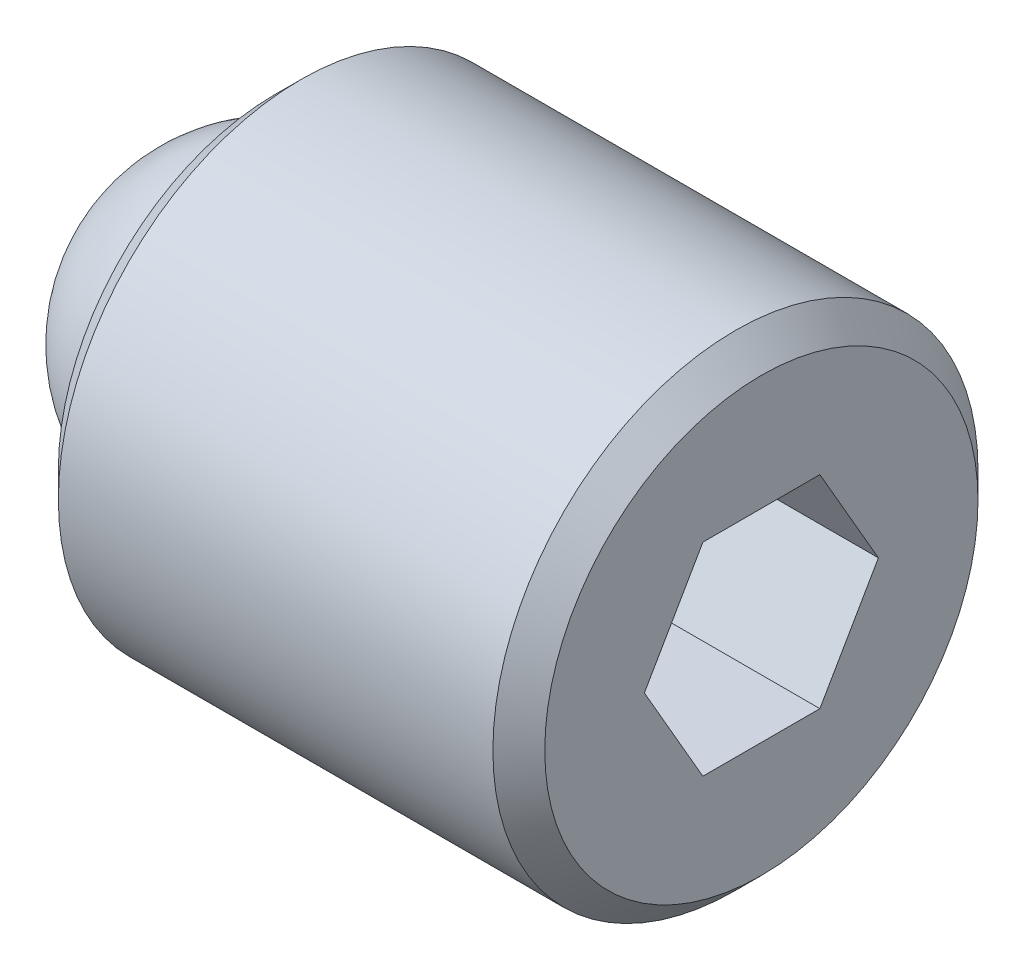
from build123d import *

# Parameters (mm, degrees)
SKETCH2_R           = 2.3749
BOSS_EXTRUDE1_DEPTH = 4.7625
CHAMFER1_SIZE       = 0.254
CHAMFER2_SIZE       = 0.254
CUT_EXTRUDE2_DEPTH  = 2.286
SKETCH3_R           = 1.5875
CUT_EXTRUDE3_DEPTH  = 1.5875


with BuildPart() as part:
    # Sketch2 → Boss-Extrude1 (new body)
    with BuildSketch(Plane(origin=(0, 0, 0), x_dir=(0, 0, -1), z_dir=(1, 0, 0))):
        with Locations(Location((0, 0, 0), (0, 0, 180))):
            Circle(SKETCH2_R)
    extrude(amount=BOSS_EXTRUDE1_DEPTH)

    # Chamfer1
    chamfer1_edges = [part.edges().sort_by_distance(p)[0] for p in [
        (0, 0, -2.3749),
    ]]
    chamfer(chamfer1_edges, length=CHAMFER1_SIZE)

    # Chamfer2
    chamfer2_edges = [part.edges().sort_by_distance(p)[0] for p in [
        (4.7625, 0, -2.3749),
    ]]
    chamfer(chamfer2_edges, length=CHAMFER2_SIZE)

    # Sketch4 → Cut-Extrude2 (cut)
    with BuildSketch(Plane(origin=(4.7625, 0, 0), x_dir=(0, 0, -1), z_dir=(1, 0, 0))):
        Polygon((1.14567944, 0), (0.57283972, 0.9921875), (-0.57283972, 0.9921875), (-1.14567944, 0), (-0.57283972, -0.9921875), (0.57283972, -0.9921875), align=None)
    extrude(amount=-CUT_EXTRUDE2_DEPTH, mode=Mode.SUBTRACT)

    # Sketch3 → Cut-Extrude3 (cut)
    with BuildSketch(Plane.ZY):
        Circle(SKETCH3_R)
    extrude(amount=-CUT_EXTRUDE3_DEPTH, mode=Mode.SUBTRACT)


with BuildPart() as body_2:
    # Sketch5 → Revolve1 (revolve)
    with BuildSketch(Plane.ZY):
        with BuildLine():
            Line((0, 0), (0, -1.5875))
            ThreePointArc((0, -1.5875), (-1.5875, 0), (0, 1.5875))
            Line((0, 1.5875), (0, 0))
        make_face()
    revolve(axis=Axis((0, 0, 0), (0, 1, 0)))


solid = Compound([part.part, body_2.part])
